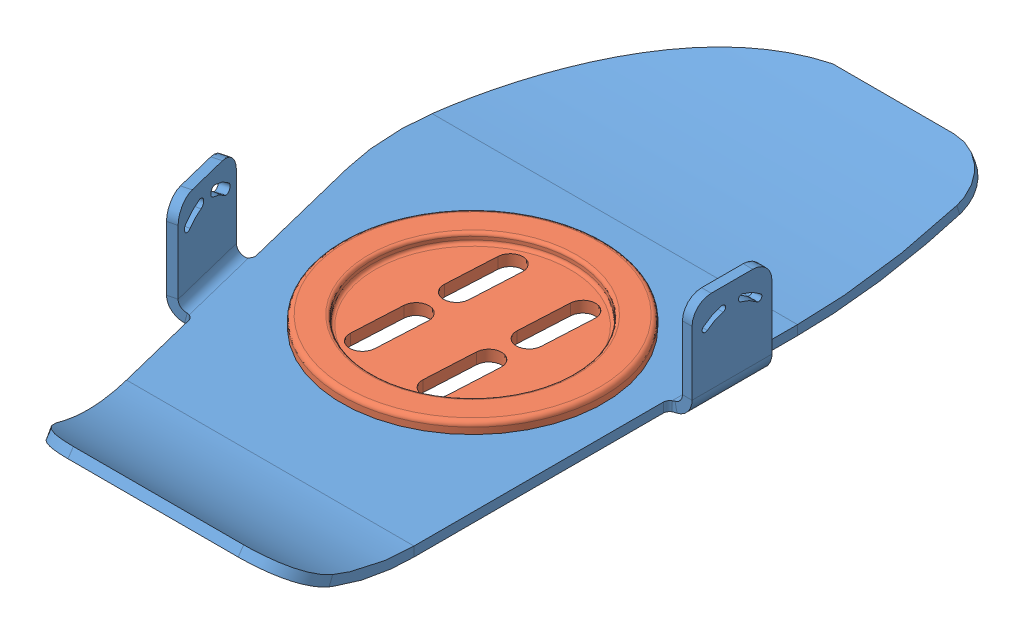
SolidWorks assembly Binding_&.SLDASM, configuration Default (file format 5000). Lengths in mm.
Overall size (122 32.01 225.02).
2 component instances, 2 part files, 2 mates.
Components (placement in the parent):
- Binding Base Plate_&-1: Binding Base Plate_&.SLDPRT [Default] at origin size (122 32.01 225.02)
- Binding Anchor_&-1: Binding Anchor_&.SLDPRT [Default] at (-50 3 -108.3533) x (0.998654 0 0.051873) z (-0.051873 0 0.998654) size (82 6.5 82)
Mates (geometry in assembly coordinates):
- Concentric1: concentric aligned: cylinder of Binding Base Plate_&-1 through (-50 0 -108.3533) axis (0 1 0) radius 38; cylinder of Binding Anchor_&-1 through (-50 0 -108.3533) axis (0 1 0) radius 37.5
- Coincident1: coincident anti-aligned: plane of Binding Base Plate_&-1 through (1 3 -120) normal (0 1 0); plane of Binding Anchor_&-1 through (-50 3 -108.3533) normal (0 -1 0)
